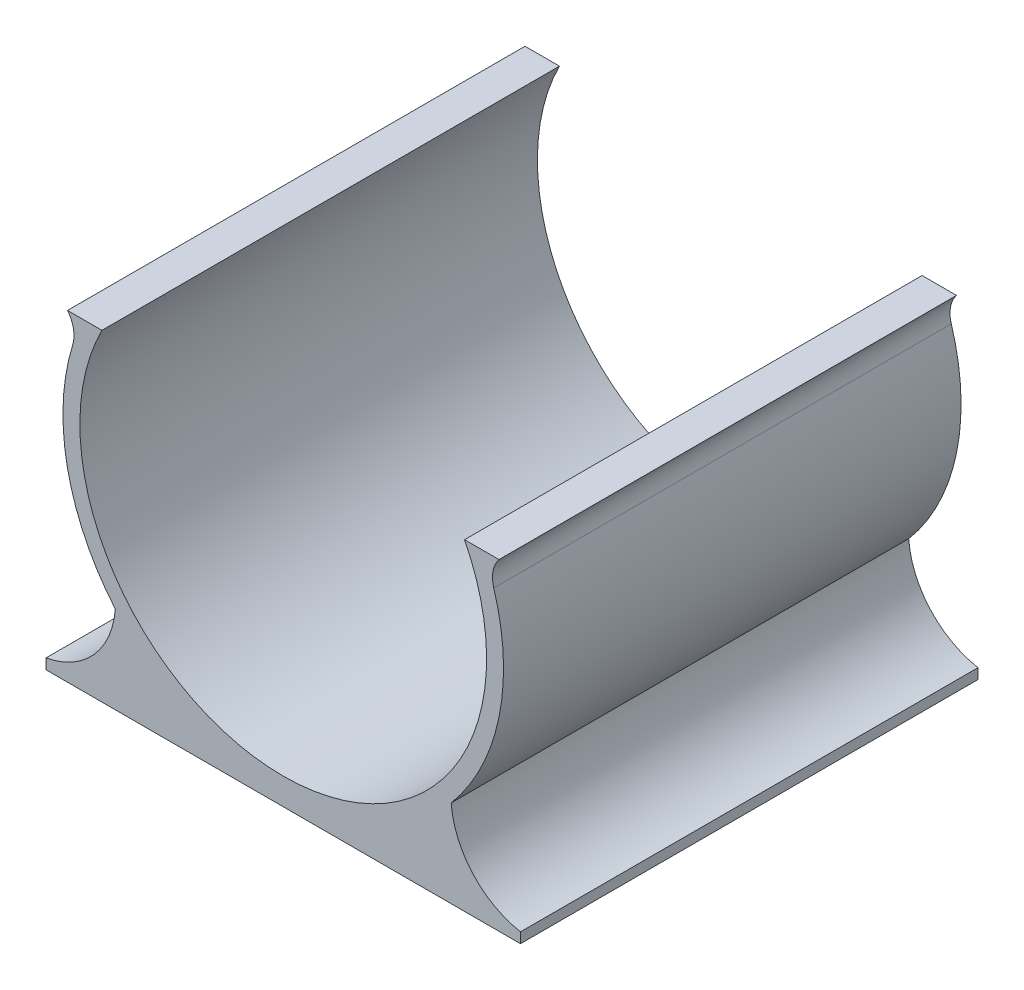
ISO-10303-21;
HEADER;
FILE_DESCRIPTION(('STEP AP214'),'2;1');
FILE_NAME('part.step','',(''),(''),'','','');
FILE_SCHEMA(('AUTOMOTIVE_DESIGN { 1 0 10303 214 1 1 1 1 }'));
ENDSEC;
DATA;
#1=APPLICATION_CONTEXT('core data for automotive mechanical design processes');
#2=APPLICATION_PROTOCOL_DEFINITION('international standard','automotive_design',2000,#1);
#3=PRODUCT_CONTEXT('',#1,'mechanical');
#4=PRODUCT('Part','Part','',(#3));
#5=PRODUCT_RELATED_PRODUCT_CATEGORY('part','',(#4));
#6=PRODUCT_DEFINITION_FORMATION('','',#4);
#7=PRODUCT_DEFINITION_CONTEXT('part definition',#1,'design');
#8=PRODUCT_DEFINITION('design','',#6,#7);
#9=PRODUCT_DEFINITION_SHAPE('','',#8);
#10=(LENGTH_UNIT() NAMED_UNIT(*) SI_UNIT(.MILLI.,.METRE.));
#11=(NAMED_UNIT(*) PLANE_ANGLE_UNIT() SI_UNIT($,.RADIAN.));
#12=(NAMED_UNIT(*) SI_UNIT($,.STERADIAN.) SOLID_ANGLE_UNIT());
#13=UNCERTAINTY_MEASURE_WITH_UNIT(LENGTH_MEASURE(1.E-05),#10,'distance_accuracy_value','');
#14=(GEOMETRIC_REPRESENTATION_CONTEXT(3) GLOBAL_UNCERTAINTY_ASSIGNED_CONTEXT((#13)) GLOBAL_UNIT_ASSIGNED_CONTEXT((#10,
#11,#12)) REPRESENTATION_CONTEXT('',''));
#15=CARTESIAN_POINT('',(0.,0.,0.));
#16=DIRECTION('',(0.,0.,1.));
#17=DIRECTION('',(1.,0.,0.));
#18=AXIS2_PLACEMENT_3D('',#15,#16,#17);
#19=CARTESIAN_POINT('',(-13.,5.,0.));
#20=DIRECTION('',(0.,-1.,0.));
#21=DIRECTION('',(0.,0.,-1.));
#22=AXIS2_PLACEMENT_3D('',#19,#20,#21);
#23=PLANE('',#22);
#24=DIRECTION('',(-1.,0.,0.));
#25=VECTOR('',#24,1.);
#26=CARTESIAN_POINT('',(15.,5.,27.));
#27=LINE('',#26,#25);
#28=CARTESIAN_POINT('',(-9.6993512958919,5.,27.));
#29=VERTEX_POINT('',#28);
#30=CARTESIAN_POINT('',(-11.7327068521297,5.,27.));
#31=VERTEX_POINT('',#30);
#32=EDGE_CURVE('E54',#29,#31,#27,.T.);
#33=ORIENTED_EDGE('',*,*,#32,.F.);
#34=DIRECTION('',(0.,0.,-1.));
#35=VECTOR('',#34,1.);
#36=CARTESIAN_POINT('',(-9.6993512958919,5.,27.001));
#37=LINE('',#36,#35);
#38=CARTESIAN_POINT('',(-9.6993512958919,5.,0.));
#39=VERTEX_POINT('',#38);
#40=EDGE_CURVE('E122',#39,#29,#37,.F.);
#41=ORIENTED_EDGE('',*,*,#40,.F.);
#42=DIRECTION('',(1.,0.,0.));
#43=VECTOR('',#42,1.);
#44=CARTESIAN_POINT('',(-13.,5.,0.));
#45=LINE('',#44,#43);
#46=CARTESIAN_POINT('',(-11.7327068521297,5.,0.));
#47=VERTEX_POINT('',#46);
#48=EDGE_CURVE('E131',#47,#39,#45,.T.);
#49=ORIENTED_EDGE('',*,*,#48,.F.);
#50=DIRECTION('',(0.,0.,-1.));
#51=VECTOR('',#50,1.);
#52=CARTESIAN_POINT('',(-11.7327068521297,5.,27.001));
#53=LINE('',#52,#51);
#54=EDGE_CURVE('E186',#31,#47,#53,.T.);
#55=ORIENTED_EDGE('',*,*,#54,.F.);
#56=EDGE_LOOP('',(#33,#41,#49,#55));
#57=FACE_BOUND('',#56,.T.);
#58=ADVANCED_FACE('F30',(#57),#23,.F.);
#59=CARTESIAN_POINT('',(-13.,5.,27.));
#60=DIRECTION('',(-1.,0.,0.));
#61=DIRECTION('',(0.,0.,1.));
#62=AXIS2_PLACEMENT_3D('',#59,#60,#61);
#63=PLANE('',#62);
#64=DIRECTION('',(0.,0.,-1.));
#65=VECTOR('',#64,1.);
#66=CARTESIAN_POINT('',(-13.,-13.3917571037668,27.001));
#67=LINE('',#66,#65);
#68=CARTESIAN_POINT('',(-13.,-13.3917571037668,27.));
#69=VERTEX_POINT('',#68);
#70=CARTESIAN_POINT('',(-13.,-13.3917571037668,0.));
#71=VERTEX_POINT('',#70);
#72=EDGE_CURVE('E169',#69,#71,#67,.T.);
#73=ORIENTED_EDGE('',*,*,#72,.T.);
#74=DIRECTION('',(0.,-1.,0.));
#75=VECTOR('',#74,1.);
#76=CARTESIAN_POINT('',(-13.,5.,0.));
#77=LINE('',#76,#75);
#78=CARTESIAN_POINT('',(-13.,-14.,0.));
#79=VERTEX_POINT('',#78);
#80=EDGE_CURVE('E34',#71,#79,#77,.T.);
#81=ORIENTED_EDGE('',*,*,#80,.T.);
#82=DIRECTION('',(0.,0.,-1.));
#83=VECTOR('',#82,1.);
#84=CARTESIAN_POINT('',(-13.,-14.,27.));
#85=LINE('',#84,#83);
#86=CARTESIAN_POINT('',(-13.,-14.,27.));
#87=VERTEX_POINT('',#86);
#88=EDGE_CURVE('E148',#87,#79,#85,.T.);
#89=ORIENTED_EDGE('',*,*,#88,.F.);
#90=DIRECTION('',(0.,-1.,0.));
#91=VECTOR('',#90,1.);
#92=CARTESIAN_POINT('',(-13.,5.,27.));
#93=LINE('',#92,#91);
#94=EDGE_CURVE('E11',#69,#87,#93,.T.);
#95=ORIENTED_EDGE('',*,*,#94,.F.);
#96=EDGE_LOOP('',(#73,#81,#89,#95));
#97=FACE_BOUND('',#96,.T.);
#98=ADVANCED_FACE('F32',(#97),#63,.T.);
#99=CARTESIAN_POINT('',(15.,5.,27.));
#100=DIRECTION('',(0.,0.,1.));
#101=DIRECTION('',(1.,0.,0.));
#102=AXIS2_PLACEMENT_3D('',#99,#100,#101);
#103=PLANE('',#102);
#104=CARTESIAN_POINT('',(1.,-0.43358830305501,27.));
#105=DIRECTION('',(0.,0.,1.));
#106=DIRECTION('',(1.,0.,0.));
#107=AXIS2_PLACEMENT_3D('',#104,#105,#106);
#108=CIRCLE('',#107,12.);
#109=CARTESIAN_POINT('',(11.6993512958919,5.,27.));
#110=VERTEX_POINT('',#109);
#111=EDGE_CURVE('E47',#110,#29,#108,.F.);
#112=ORIENTED_EDGE('',*,*,#111,.T.);
#113=ORIENTED_EDGE('',*,*,#32,.T.);
#114=CARTESIAN_POINT('',(-13.0871850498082,3.9067121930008,27.));
#115=DIRECTION('',(0.,0.,1.));
#116=DIRECTION('',(1.,0.,0.));
#117=AXIS2_PLACEMENT_3D('',#114,#115,#116);
#118=CIRCLE('',#117,1.74065775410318);
#119=CARTESIAN_POINT('',(-11.4236929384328,3.39418569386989,27.));
#120=VERTEX_POINT('',#119);
#121=EDGE_CURVE('E183',#31,#120,#118,.F.);
#122=ORIENTED_EDGE('',*,*,#121,.T.);
#123=CARTESIAN_POINT('',(1.,-0.43358830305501,27.));
#124=DIRECTION('',(0.,0.,1.));
#125=DIRECTION('',(1.,0.,0.));
#126=AXIS2_PLACEMENT_3D('',#123,#124,#125);
#127=CIRCLE('',#126,13.);
#128=CARTESIAN_POINT('',(-8.90979882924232,-8.84761749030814,27.));
#129=VERTEX_POINT('',#128);
#130=EDGE_CURVE('E180',#120,#129,#127,.T.);
#131=ORIENTED_EDGE('',*,*,#130,.T.);
#132=CARTESIAN_POINT('',(-13.8957183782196,-8.47264248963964,27.));
#133=DIRECTION('',(0.,0.,1.));
#134=DIRECTION('',(1.,0.,0.));
#135=AXIS2_PLACEMENT_3D('',#132,#133,#134);
#136=CIRCLE('',#135,5.);
#137=EDGE_CURVE('E179',#129,#69,#136,.F.);
#138=ORIENTED_EDGE('',*,*,#137,.T.);
#139=ORIENTED_EDGE('',*,*,#94,.T.);
#140=DIRECTION('',(-1.,0.,0.));
#141=VECTOR('',#140,1.);
#142=CARTESIAN_POINT('',(15.,-14.,27.));
#143=LINE('',#142,#141);
#144=CARTESIAN_POINT('',(15.,-14.,27.));
#145=VERTEX_POINT('',#144);
#146=EDGE_CURVE('E142',#145,#87,#143,.T.);
#147=ORIENTED_EDGE('',*,*,#146,.F.);
#148=DIRECTION('',(0.,-1.,0.));
#149=VECTOR('',#148,1.);
#150=CARTESIAN_POINT('',(15.,5.,27.));
#151=LINE('',#150,#149);
#152=CARTESIAN_POINT('',(15.,-13.3917571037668,27.));
#153=VERTEX_POINT('',#152);
#154=EDGE_CURVE('E39',#153,#145,#151,.T.);
#155=ORIENTED_EDGE('',*,*,#154,.F.);
#156=CARTESIAN_POINT('',(15.8957183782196,-8.47264248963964,27.));
#157=DIRECTION('',(0.,0.,1.));
#158=DIRECTION('',(1.,0.,0.));
#159=AXIS2_PLACEMENT_3D('',#156,#157,#158);
#160=CIRCLE('',#159,5.);
#161=CARTESIAN_POINT('',(10.9097988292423,-8.84761749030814,27.));
#162=VERTEX_POINT('',#161);
#163=EDGE_CURVE('E209',#153,#162,#160,.F.);
#164=ORIENTED_EDGE('',*,*,#163,.T.);
#165=CARTESIAN_POINT('',(1.,-0.43358830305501,27.));
#166=DIRECTION('',(0.,0.,1.));
#167=DIRECTION('',(1.,0.,0.));
#168=AXIS2_PLACEMENT_3D('',#165,#166,#167);
#169=CIRCLE('',#168,13.);
#170=CARTESIAN_POINT('',(13.4236929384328,3.39418569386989,27.));
#171=VERTEX_POINT('',#170);
#172=EDGE_CURVE('E144',#162,#171,#169,.T.);
#173=ORIENTED_EDGE('',*,*,#172,.T.);
#174=CARTESIAN_POINT('',(15.0871850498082,3.9067121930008,27.));
#175=DIRECTION('',(0.,0.,1.));
#176=DIRECTION('',(1.,0.,0.));
#177=AXIS2_PLACEMENT_3D('',#174,#175,#176);
#178=CIRCLE('',#177,1.74065775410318);
#179=CARTESIAN_POINT('',(13.7327068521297,5.,27.));
#180=VERTEX_POINT('',#179);
#181=EDGE_CURVE('E206',#171,#180,#178,.F.);
#182=ORIENTED_EDGE('',*,*,#181,.T.);
#183=EDGE_CURVE('E140',#180,#110,#27,.T.);
#184=ORIENTED_EDGE('',*,*,#183,.T.);
#185=EDGE_LOOP('',(#112,#113,#122,#131,#138,#139,#147,#155,#164,#173,#182,#184));
#186=FACE_BOUND('',#185,.T.);
#187=ADVANCED_FACE('F175',(#186),#103,.T.);
#188=CARTESIAN_POINT('',(15.,5.,0.));
#189=DIRECTION('',(1.,0.,0.));
#190=DIRECTION('',(0.,0.,-1.));
#191=AXIS2_PLACEMENT_3D('',#188,#189,#190);
#192=PLANE('',#191);
#193=DIRECTION('',(0.,0.,-1.));
#194=VECTOR('',#193,1.);
#195=CARTESIAN_POINT('',(15.,-13.3917571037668,27.001));
#196=LINE('',#195,#194);
#197=CARTESIAN_POINT('',(15.,-13.3917571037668,0.));
#198=VERTEX_POINT('',#197);
#199=EDGE_CURVE('E203',#198,#153,#196,.F.);
#200=ORIENTED_EDGE('',*,*,#199,.T.);
#201=ORIENTED_EDGE('',*,*,#154,.T.);
#202=DIRECTION('',(0.,0.,1.));
#203=VECTOR('',#202,1.);
#204=CARTESIAN_POINT('',(15.,-14.,0.));
#205=LINE('',#204,#203);
#206=CARTESIAN_POINT('',(15.,-14.,0.));
#207=VERTEX_POINT('',#206);
#208=EDGE_CURVE('E154',#207,#145,#205,.T.);
#209=ORIENTED_EDGE('',*,*,#208,.F.);
#210=DIRECTION('',(0.,-1.,0.));
#211=VECTOR('',#210,1.);
#212=CARTESIAN_POINT('',(15.,5.,0.));
#213=LINE('',#212,#211);
#214=EDGE_CURVE('E159',#198,#207,#213,.T.);
#215=ORIENTED_EDGE('',*,*,#214,.F.);
#216=EDGE_LOOP('',(#200,#201,#209,#215));
#217=FACE_BOUND('',#216,.T.);
#218=ADVANCED_FACE('F238',(#217),#192,.T.);
#219=CARTESIAN_POINT('',(-13.,5.,0.));
#220=DIRECTION('',(0.,0.,-1.));
#221=DIRECTION('',(-1.,0.,0.));
#222=AXIS2_PLACEMENT_3D('',#219,#220,#221);
#223=PLANE('',#222);
#224=CARTESIAN_POINT('',(1.,-0.43358830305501,0.));
#225=DIRECTION('',(0.,0.,-1.));
#226=DIRECTION('',(-1.,0.,0.));
#227=AXIS2_PLACEMENT_3D('',#224,#225,#226);
#228=CIRCLE('',#227,12.);
#229=CARTESIAN_POINT('',(11.6993512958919,5.,0.));
#230=VERTEX_POINT('',#229);
#231=EDGE_CURVE('E119',#230,#39,#228,.T.);
#232=ORIENTED_EDGE('',*,*,#231,.F.);
#233=CARTESIAN_POINT('',(13.7327068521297,5.,0.));
#234=VERTEX_POINT('',#233);
#235=EDGE_CURVE('E138',#230,#234,#45,.T.);
#236=ORIENTED_EDGE('',*,*,#235,.T.);
#237=CARTESIAN_POINT('',(15.0871850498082,3.9067121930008,0.));
#238=DIRECTION('',(0.,0.,-1.));
#239=DIRECTION('',(-1.,0.,0.));
#240=AXIS2_PLACEMENT_3D('',#237,#238,#239);
#241=CIRCLE('',#240,1.74065775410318);
#242=CARTESIAN_POINT('',(13.4236929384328,3.39418569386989,0.));
#243=VERTEX_POINT('',#242);
#244=EDGE_CURVE('E217',#243,#234,#241,.T.);
#245=ORIENTED_EDGE('',*,*,#244,.F.);
#246=CARTESIAN_POINT('',(1.,-0.43358830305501,0.));
#247=DIRECTION('',(0.,0.,1.));
#248=DIRECTION('',(1.,0.,0.));
#249=AXIS2_PLACEMENT_3D('',#246,#247,#248);
#250=CIRCLE('',#249,13.);
#251=CARTESIAN_POINT('',(10.9097988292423,-8.84761749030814,0.));
#252=VERTEX_POINT('',#251);
#253=EDGE_CURVE('E214',#252,#243,#250,.T.);
#254=ORIENTED_EDGE('',*,*,#253,.F.);
#255=CARTESIAN_POINT('',(15.8957183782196,-8.47264248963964,0.));
#256=DIRECTION('',(0.,0.,-1.));
#257=DIRECTION('',(-1.,0.,0.));
#258=AXIS2_PLACEMENT_3D('',#255,#256,#257);
#259=CIRCLE('',#258,5.);
#260=EDGE_CURVE('E211',#198,#252,#259,.T.);
#261=ORIENTED_EDGE('',*,*,#260,.F.);
#262=ORIENTED_EDGE('',*,*,#214,.T.);
#263=DIRECTION('',(1.,0.,0.));
#264=VECTOR('',#263,1.);
#265=CARTESIAN_POINT('',(-13.,-14.,0.));
#266=LINE('',#265,#264);
#267=EDGE_CURVE('E151',#79,#207,#266,.T.);
#268=ORIENTED_EDGE('',*,*,#267,.F.);
#269=ORIENTED_EDGE('',*,*,#80,.F.);
#270=CARTESIAN_POINT('',(-13.8957183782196,-8.47264248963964,0.));
#271=DIRECTION('',(0.,0.,-1.));
#272=DIRECTION('',(1.,0.,0.));
#273=AXIS2_PLACEMENT_3D('',#270,#271,#272);
#274=CIRCLE('',#273,5.);
#275=CARTESIAN_POINT('',(-8.90979882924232,-8.84761749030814,0.));
#276=VERTEX_POINT('',#275);
#277=EDGE_CURVE('E194',#276,#71,#274,.T.);
#278=ORIENTED_EDGE('',*,*,#277,.F.);
#279=CARTESIAN_POINT('',(1.,-0.43358830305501,0.));
#280=DIRECTION('',(0.,0.,1.));
#281=DIRECTION('',(-1.,0.,0.));
#282=AXIS2_PLACEMENT_3D('',#279,#280,#281);
#283=CIRCLE('',#282,13.);
#284=CARTESIAN_POINT('',(-11.4236929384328,3.39418569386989,0.));
#285=VERTEX_POINT('',#284);
#286=EDGE_CURVE('E191',#285,#276,#283,.T.);
#287=ORIENTED_EDGE('',*,*,#286,.F.);
#288=CARTESIAN_POINT('',(-13.0871850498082,3.9067121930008,0.));
#289=DIRECTION('',(0.,0.,-1.));
#290=DIRECTION('',(1.,0.,0.));
#291=AXIS2_PLACEMENT_3D('',#288,#289,#290);
#292=CIRCLE('',#291,1.74065775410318);
#293=EDGE_CURVE('E137',#47,#285,#292,.T.);
#294=ORIENTED_EDGE('',*,*,#293,.F.);
#295=ORIENTED_EDGE('',*,*,#48,.T.);
#296=EDGE_LOOP('',(#232,#236,#245,#254,#261,#262,#268,#269,#278,#287,#294,#295));
#297=FACE_BOUND('',#296,.T.);
#298=ADVANCED_FACE('F134',(#297),#223,.T.);
#299=ORIENTED_EDGE('',*,*,#235,.F.);
#300=DIRECTION('',(0.,0.,-1.));
#301=VECTOR('',#300,1.);
#302=CARTESIAN_POINT('',(11.6993512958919,5.,27.001));
#303=LINE('',#302,#301);
#304=EDGE_CURVE('E123',#110,#230,#303,.T.);
#305=ORIENTED_EDGE('',*,*,#304,.F.);
#306=ORIENTED_EDGE('',*,*,#183,.F.);
#307=DIRECTION('',(0.,0.,-1.));
#308=VECTOR('',#307,1.);
#309=CARTESIAN_POINT('',(13.7327068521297,5.,27.001));
#310=LINE('',#309,#308);
#311=EDGE_CURVE('E201',#234,#180,#310,.F.);
#312=ORIENTED_EDGE('',*,*,#311,.F.);
#313=EDGE_LOOP('',(#299,#305,#306,#312));
#314=FACE_BOUND('',#313,.T.);
#315=ADVANCED_FACE('F236',(#314),#23,.F.);
#316=CARTESIAN_POINT('',(-13.,-14.,0.));
#317=DIRECTION('',(0.,-1.,0.));
#318=DIRECTION('',(0.,0.,-1.));
#319=AXIS2_PLACEMENT_3D('',#316,#317,#318);
#320=PLANE('',#319);
#321=ORIENTED_EDGE('',*,*,#88,.T.);
#322=ORIENTED_EDGE('',*,*,#267,.T.);
#323=ORIENTED_EDGE('',*,*,#208,.T.);
#324=ORIENTED_EDGE('',*,*,#146,.T.);
#325=EDGE_LOOP('',(#321,#322,#323,#324));
#326=FACE_BOUND('',#325,.T.);
#327=ADVANCED_FACE('F172',(#326),#320,.T.);
#328=CARTESIAN_POINT('',(15.8957183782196,-8.47264248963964,27.001));
#329=DIRECTION('',(0.,0.,-1.));
#330=DIRECTION('',(-1.,0.,0.));
#331=AXIS2_PLACEMENT_3D('',#328,#329,#330);
#332=CYLINDRICAL_SURFACE('',#331,5.);
#333=ORIENTED_EDGE('',*,*,#199,.F.);
#334=ORIENTED_EDGE('',*,*,#260,.T.);
#335=DIRECTION('',(0.,0.,-1.));
#336=VECTOR('',#335,1.);
#337=CARTESIAN_POINT('',(10.9097988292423,-8.84761749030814,27.001));
#338=LINE('',#337,#336);
#339=EDGE_CURVE('E220',#162,#252,#338,.T.);
#340=ORIENTED_EDGE('',*,*,#339,.F.);
#341=ORIENTED_EDGE('',*,*,#163,.F.);
#342=EDGE_LOOP('',(#333,#334,#340,#341));
#343=FACE_BOUND('',#342,.T.);
#344=ADVANCED_FACE('F229',(#343),#332,.F.);
#345=CARTESIAN_POINT('',(15.0871850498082,3.9067121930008,27.001));
#346=DIRECTION('',(0.,0.,-1.));
#347=DIRECTION('',(-1.,0.,0.));
#348=AXIS2_PLACEMENT_3D('',#345,#346,#347);
#349=CYLINDRICAL_SURFACE('',#348,1.74065775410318);
#350=DIRECTION('',(0.,0.,-1.));
#351=VECTOR('',#350,1.);
#352=CARTESIAN_POINT('',(13.4236929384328,3.39418569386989,27.001));
#353=LINE('',#352,#351);
#354=EDGE_CURVE('E221',#171,#243,#353,.T.);
#355=ORIENTED_EDGE('',*,*,#354,.T.);
#356=ORIENTED_EDGE('',*,*,#244,.T.);
#357=ORIENTED_EDGE('',*,*,#311,.T.);
#358=ORIENTED_EDGE('',*,*,#181,.F.);
#359=EDGE_LOOP('',(#355,#356,#357,#358));
#360=FACE_BOUND('',#359,.T.);
#361=ADVANCED_FACE('F232',(#360),#349,.F.);
#362=CARTESIAN_POINT('',(1.,-0.43358830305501,27.001));
#363=DIRECTION('',(0.,0.,-1.));
#364=DIRECTION('',(-1.,0.,0.));
#365=AXIS2_PLACEMENT_3D('',#362,#363,#364);
#366=CYLINDRICAL_SURFACE('',#365,13.);
#367=ORIENTED_EDGE('',*,*,#339,.T.);
#368=ORIENTED_EDGE('',*,*,#253,.T.);
#369=ORIENTED_EDGE('',*,*,#354,.F.);
#370=ORIENTED_EDGE('',*,*,#172,.F.);
#371=EDGE_LOOP('',(#367,#368,#369,#370));
#372=FACE_BOUND('',#371,.T.);
#373=ADVANCED_FACE('F224',(#372),#366,.T.);
#374=CARTESIAN_POINT('',(-13.0871850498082,3.9067121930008,27.001));
#375=DIRECTION('',(0.,0.,-1.));
#376=DIRECTION('',(-1.,0.,0.));
#377=AXIS2_PLACEMENT_3D('',#374,#375,#376);
#378=CYLINDRICAL_SURFACE('',#377,1.74065775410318);
#379=ORIENTED_EDGE('',*,*,#54,.T.);
#380=ORIENTED_EDGE('',*,*,#293,.T.);
#381=DIRECTION('',(0.,0.,-1.));
#382=VECTOR('',#381,1.);
#383=CARTESIAN_POINT('',(-11.4236929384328,3.39418569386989,27.001));
#384=LINE('',#383,#382);
#385=EDGE_CURVE('E196',#120,#285,#384,.T.);
#386=ORIENTED_EDGE('',*,*,#385,.F.);
#387=ORIENTED_EDGE('',*,*,#121,.F.);
#388=EDGE_LOOP('',(#379,#380,#386,#387));
#389=FACE_BOUND('',#388,.T.);
#390=ADVANCED_FACE('F266',(#389),#378,.F.);
#391=CARTESIAN_POINT('',(-13.8957183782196,-8.47264248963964,27.001));
#392=DIRECTION('',(0.,0.,-1.));
#393=DIRECTION('',(-1.,0.,0.));
#394=AXIS2_PLACEMENT_3D('',#391,#392,#393);
#395=CYLINDRICAL_SURFACE('',#394,5.);
#396=ORIENTED_EDGE('',*,*,#137,.F.);
#397=DIRECTION('',(0.,0.,-1.));
#398=VECTOR('',#397,1.);
#399=CARTESIAN_POINT('',(-8.90979882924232,-8.84761749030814,27.001));
#400=LINE('',#399,#398);
#401=EDGE_CURVE('E197',#129,#276,#400,.T.);
#402=ORIENTED_EDGE('',*,*,#401,.T.);
#403=ORIENTED_EDGE('',*,*,#277,.T.);
#404=ORIENTED_EDGE('',*,*,#72,.F.);
#405=EDGE_LOOP('',(#396,#402,#403,#404));
#406=FACE_BOUND('',#405,.T.);
#407=ADVANCED_FACE('F270',(#406),#395,.F.);
#408=CARTESIAN_POINT('',(1.,-0.43358830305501,27.001));
#409=DIRECTION('',(0.,0.,-1.));
#410=DIRECTION('',(-1.,0.,0.));
#411=AXIS2_PLACEMENT_3D('',#408,#409,#410);
#412=CYLINDRICAL_SURFACE('',#411,13.);
#413=ORIENTED_EDGE('',*,*,#385,.T.);
#414=ORIENTED_EDGE('',*,*,#286,.T.);
#415=ORIENTED_EDGE('',*,*,#401,.F.);
#416=ORIENTED_EDGE('',*,*,#130,.F.);
#417=EDGE_LOOP('',(#413,#414,#415,#416));
#418=FACE_BOUND('',#417,.T.);
#419=ADVANCED_FACE('F272',(#418),#412,.T.);
#420=CARTESIAN_POINT('',(1.,-0.43358830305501,27.001));
#421=DIRECTION('',(0.,0.,-1.));
#422=DIRECTION('',(-1.,0.,0.));
#423=AXIS2_PLACEMENT_3D('',#420,#421,#422);
#424=CYLINDRICAL_SURFACE('',#423,12.);
#425=ORIENTED_EDGE('',*,*,#40,.T.);
#426=ORIENTED_EDGE('',*,*,#111,.F.);
#427=ORIENTED_EDGE('',*,*,#304,.T.);
#428=ORIENTED_EDGE('',*,*,#231,.T.);
#429=EDGE_LOOP('',(#425,#426,#427,#428));
#430=FACE_BOUND('',#429,.T.);
#431=ADVANCED_FACE('F121',(#430),#424,.F.);
#432=CLOSED_SHELL('',(#58,#98,#187,#218,#298,#315,#327,#344,#361,#373,#390,#407,#419,#431));
#433=MANIFOLD_SOLID_BREP('B2',#432);
#434=ADVANCED_BREP_SHAPE_REPRESENTATION('',(#18,#433),#14);
#435=SHAPE_DEFINITION_REPRESENTATION(#9,#434);
ENDSEC;
END-ISO-10303-21;
